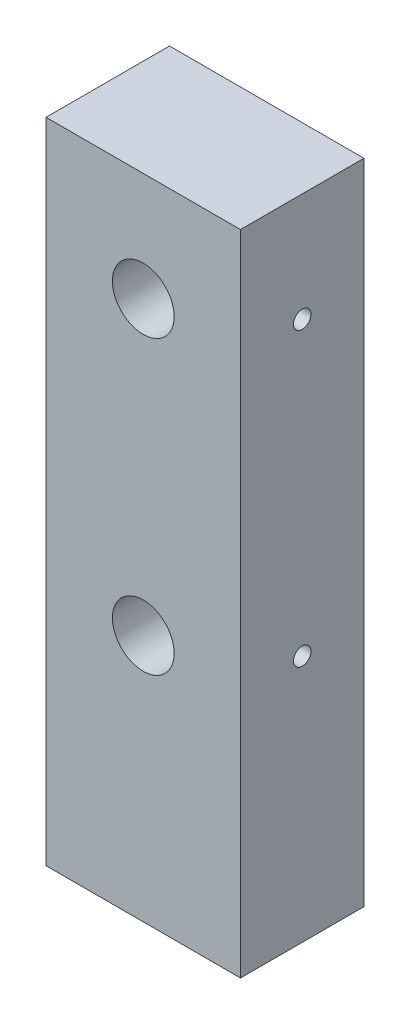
from build123d import *

# Parameters (mm, degrees)
SKETCH1_W                  = 30
SKETCH1_H                  = 19.05
BOSS_EXTRUDE1_DEPTH        = 100
M5X0_8_TAPPED_HOLE1_D      = 4.2
M5X0_8_TAPPED_HOLE1_DEPTH  = 12.4
M5X0_8_TAPPED_HOLE1_TIP    = 1.2618073
SKETCH4_R                  = 4.7625
CUT_EXTRUDE1_DEPTH         = 103.897533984
F_6_32_TAPPED_HOLE1_REACH  = 106.837
F_6_32_TAPPED_HOLE1_BORE_R = 1.35255


with BuildPart() as part:
    # Sketch1 → Boss-Extrude1 (new body)
    with BuildSketch(Plane(origin=(0, 0, 0), x_dir=(1, 0, 0), z_dir=(0, 1, 0))):
        Rectangle(SKETCH1_W, SKETCH1_H)
    extrude(amount=BOSS_EXTRUDE1_DEPTH)

    # M5x0.8 Tapped Hole1
    with Locations(Plane.XZ):
        with Locations((-10, 0), (10, 0)):
            Hole(M5X0_8_TAPPED_HOLE1_D / 2, depth=M5X0_8_TAPPED_HOLE1_DEPTH)
            with Locations((0, 0, -(M5X0_8_TAPPED_HOLE1_DEPTH + M5X0_8_TAPPED_HOLE1_TIP / 2))):  # 118° drill point
                Cone(0, M5X0_8_TAPPED_HOLE1_D / 2, M5X0_8_TAPPED_HOLE1_TIP, mode=Mode.SUBTRACT)

    # Sketch4 → Cut-Extrude1 (cut, through all)
    with BuildSketch(Plane(origin=(0, 0, -9.525), x_dir=(-1, 0, 0), z_dir=(0, 0, -1))):
        with Locations((0, 38.25)):
            Circle(SKETCH4_R)
        with Locations((0, 83.25)):
            Circle(SKETCH4_R)
    extrude(amount=-CUT_EXTRUDE1_DEPTH, mode=Mode.SUBTRACT)

    # 6-32 Tapped Hole1 bore → 6-32 Tapped Hole1 (cut, up to next)
    with BuildSketch(Plane(origin=(15, 0, 0), x_dir=(0, 0, -1), z_dir=(1, 0, 0)), mode=Mode.PRIVATE) as f_6_32_tapped_hole1_sk1:
        with Locations((0, 38.25)):
            Circle(F_6_32_TAPPED_HOLE1_BORE_R)
    f_6_32_tapped_hole1_tool1 = extrude(f_6_32_tapped_hole1_sk1.sketch, amount=-F_6_32_TAPPED_HOLE1_REACH, mode=Mode.PRIVATE) & part.part
    # 6-32 Tapped Hole1 bore → 6-32 Tapped Hole1 (cut, up to next)
    with BuildSketch(Plane(origin=(15, 0, 0), x_dir=(0, 0, -1), z_dir=(1, 0, 0)), mode=Mode.PRIVATE) as f_6_32_tapped_hole1_sk2:
        with Locations((0, 83.25)):
            Circle(F_6_32_TAPPED_HOLE1_BORE_R)
    f_6_32_tapped_hole1_tool2 = extrude(f_6_32_tapped_hole1_sk2.sketch, amount=-F_6_32_TAPPED_HOLE1_REACH, mode=Mode.PRIVATE) & part.part
    add(f_6_32_tapped_hole1_tool1.solids().sort_by_distance((15, 38.25, 0))[0], mode=Mode.SUBTRACT)
    add(f_6_32_tapped_hole1_tool2.solids().sort_by_distance((15, 83.25, 0))[0], mode=Mode.SUBTRACT)


solid = part.part
